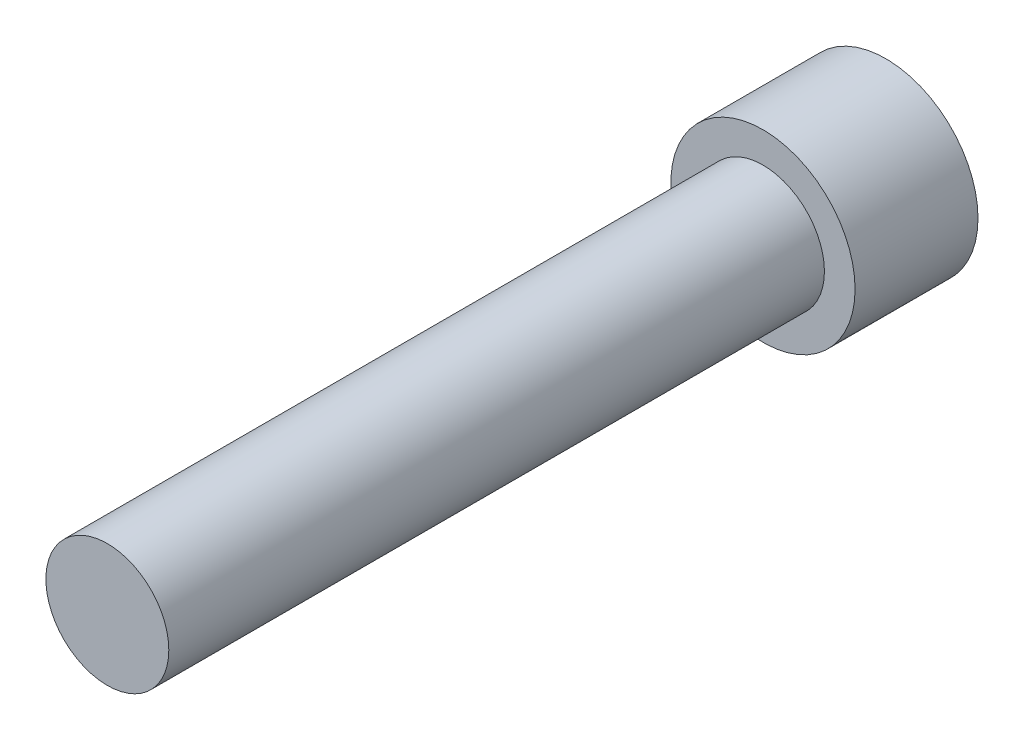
ISO-10303-21;
HEADER;
FILE_DESCRIPTION(('STEP AP214'),'2;1');
FILE_NAME('part.step','',(''),(''),'','','');
FILE_SCHEMA(('AUTOMOTIVE_DESIGN { 1 0 10303 214 1 1 1 1 }'));
ENDSEC;
DATA;
#1=APPLICATION_CONTEXT('core data for automotive mechanical design processes');
#2=APPLICATION_PROTOCOL_DEFINITION('international standard','automotive_design',2000,#1);
#3=PRODUCT_CONTEXT('',#1,'mechanical');
#4=PRODUCT('Part','Part','',(#3));
#5=PRODUCT_RELATED_PRODUCT_CATEGORY('part','',(#4));
#6=PRODUCT_DEFINITION_FORMATION('','',#4);
#7=PRODUCT_DEFINITION_CONTEXT('part definition',#1,'design');
#8=PRODUCT_DEFINITION('design','',#6,#7);
#9=PRODUCT_DEFINITION_SHAPE('','',#8);
#10=(LENGTH_UNIT() NAMED_UNIT(*) SI_UNIT(.MILLI.,.METRE.));
#11=(NAMED_UNIT(*) PLANE_ANGLE_UNIT() SI_UNIT($,.RADIAN.));
#12=(NAMED_UNIT(*) SI_UNIT($,.STERADIAN.) SOLID_ANGLE_UNIT());
#13=UNCERTAINTY_MEASURE_WITH_UNIT(LENGTH_MEASURE(1.E-05),#10,'distance_accuracy_value','');
#14=(GEOMETRIC_REPRESENTATION_CONTEXT(3) GLOBAL_UNCERTAINTY_ASSIGNED_CONTEXT((#13)) GLOBAL_UNIT_ASSIGNED_CONTEXT((#10,
#11,#12)) REPRESENTATION_CONTEXT('',''));
#15=CARTESIAN_POINT('',(0.,0.,0.));
#16=DIRECTION('',(0.,0.,1.));
#17=DIRECTION('',(1.,0.,0.));
#18=AXIS2_PLACEMENT_3D('',#15,#16,#17);
#19=CARTESIAN_POINT('',(0.,0.,50.8));
#20=DIRECTION('',(0.,0.,1.));
#21=DIRECTION('',(1.,0.,0.));
#22=AXIS2_PLACEMENT_3D('',#19,#20,#21);
#23=PLANE('',#22);
#24=CARTESIAN_POINT('',(0.,0.,50.8));
#25=DIRECTION('',(0.,0.,1.));
#26=DIRECTION('',(1.,0.,0.));
#27=AXIS2_PLACEMENT_3D('',#24,#25,#26);
#28=CIRCLE('',#27,4.7625);
#29=CARTESIAN_POINT('',(4.7625,0.,50.8));
#30=VERTEX_POINT('',#29);
#31=EDGE_CURVE('E11',#30,#30,#28,.T.);
#32=ORIENTED_EDGE('',*,*,#31,.T.);
#33=EDGE_LOOP('',(#32));
#34=FACE_BOUND('',#33,.T.);
#35=ADVANCED_FACE('F32',(#34),#23,.T.);
#36=CARTESIAN_POINT('',(0.,0.,50.8));
#37=DIRECTION('',(0.,0.,1.));
#38=DIRECTION('',(1.,0.,0.));
#39=AXIS2_PLACEMENT_3D('',#36,#37,#38);
#40=CYLINDRICAL_SURFACE('',#39,4.7625);
#41=CARTESIAN_POINT('',(0.,0.,0.));
#42=DIRECTION('',(0.,0.,1.));
#43=DIRECTION('',(1.,0.,0.));
#44=AXIS2_PLACEMENT_3D('',#41,#42,#43);
#45=CIRCLE('',#44,4.7625);
#46=CARTESIAN_POINT('',(4.7625,0.,0.));
#47=VERTEX_POINT('',#46);
#48=EDGE_CURVE('E39',#47,#47,#45,.T.);
#49=ORIENTED_EDGE('',*,*,#48,.T.);
#50=EDGE_LOOP('',(#49));
#51=FACE_BOUND('',#50,.T.);
#52=ORIENTED_EDGE('',*,*,#31,.F.);
#53=EDGE_LOOP('',(#52));
#54=FACE_BOUND('',#53,.T.);
#55=ADVANCED_FACE('F146',(#51,#54),#40,.T.);
#56=CARTESIAN_POINT('',(0.,-4.7625,0.));
#57=DIRECTION('',(0.,0.,1.));
#58=DIRECTION('',(1.,0.,0.));
#59=AXIS2_PLACEMENT_3D('',#56,#57,#58);
#60=PLANE('',#59);
#61=CARTESIAN_POINT('',(0.,0.,0.));
#62=DIRECTION('',(0.,0.,1.));
#63=DIRECTION('',(1.,0.,0.));
#64=AXIS2_PLACEMENT_3D('',#61,#62,#63);
#65=CIRCLE('',#64,7.1374);
#66=CARTESIAN_POINT('',(7.1374,0.,0.));
#67=VERTEX_POINT('',#66);
#68=EDGE_CURVE('E141',#67,#67,#65,.T.);
#69=ORIENTED_EDGE('',*,*,#68,.T.);
#70=EDGE_LOOP('',(#69));
#71=FACE_BOUND('',#70,.T.);
#72=ORIENTED_EDGE('',*,*,#48,.F.);
#73=EDGE_LOOP('',(#72));
#74=FACE_BOUND('',#73,.T.);
#75=ADVANCED_FACE('F149',(#71,#74),#60,.T.);
#76=CARTESIAN_POINT('',(0.,0.,50.8));
#77=DIRECTION('',(0.,0.,1.));
#78=DIRECTION('',(1.,0.,0.));
#79=AXIS2_PLACEMENT_3D('',#76,#77,#78);
#80=CYLINDRICAL_SURFACE('',#79,7.1374);
#81=CARTESIAN_POINT('',(0.,0.,-9.525));
#82=DIRECTION('',(0.,0.,1.));
#83=DIRECTION('',(1.,0.,0.));
#84=AXIS2_PLACEMENT_3D('',#81,#82,#83);
#85=CIRCLE('',#84,7.1374);
#86=CARTESIAN_POINT('',(7.1374,0.,-9.525));
#87=VERTEX_POINT('',#86);
#88=EDGE_CURVE('E133',#87,#87,#85,.T.);
#89=ORIENTED_EDGE('',*,*,#88,.T.);
#90=EDGE_LOOP('',(#89));
#91=FACE_BOUND('',#90,.T.);
#92=ORIENTED_EDGE('',*,*,#68,.F.);
#93=EDGE_LOOP('',(#92));
#94=FACE_BOUND('',#93,.T.);
#95=ADVANCED_FACE('F151',(#91,#94),#80,.T.);
#96=CARTESIAN_POINT('',(0.,-7.1374,-9.525));
#97=DIRECTION('',(0.,0.,-1.));
#98=DIRECTION('',(-1.,0.,0.));
#99=AXIS2_PLACEMENT_3D('',#96,#97,#98);
#100=PLANE('',#99);
#101=DIRECTION('',(0.866025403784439,-0.5,0.));
#102=VECTOR('',#101,1.);
#103=CARTESIAN_POINT('',(0.,4.57538541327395,-9.525));
#104=LINE('',#103,#102);
#105=CARTESIAN_POINT('',(0.,4.57538541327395,-9.525));
#106=VERTEX_POINT('',#105);
#107=CARTESIAN_POINT('',(3.9624,2.28769270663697,-9.525));
#108=VERTEX_POINT('',#107);
#109=EDGE_CURVE('E46',#106,#108,#104,.T.);
#110=ORIENTED_EDGE('',*,*,#109,.F.);
#111=DIRECTION('',(0.866025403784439,0.5,0.));
#112=VECTOR('',#111,1.);
#113=CARTESIAN_POINT('',(-3.9624,2.28769270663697,-9.525));
#114=LINE('',#113,#112);
#115=CARTESIAN_POINT('',(-3.9624,2.28769270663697,-9.525));
#116=VERTEX_POINT('',#115);
#117=EDGE_CURVE('E129',#116,#106,#114,.T.);
#118=ORIENTED_EDGE('',*,*,#117,.F.);
#119=DIRECTION('',(0.,1.,0.));
#120=VECTOR('',#119,1.);
#121=CARTESIAN_POINT('',(-3.9624,-2.28769270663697,-9.525));
#122=LINE('',#121,#120);
#123=CARTESIAN_POINT('',(-3.9624,-2.28769270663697,-9.525));
#124=VERTEX_POINT('',#123);
#125=EDGE_CURVE('E127',#124,#116,#122,.T.);
#126=ORIENTED_EDGE('',*,*,#125,.F.);
#127=DIRECTION('',(-0.866025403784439,0.5,0.));
#128=VECTOR('',#127,1.);
#129=CARTESIAN_POINT('',(0.,-4.57538541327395,-9.525));
#130=LINE('',#129,#128);
#131=CARTESIAN_POINT('',(0.,-4.57538541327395,-9.525));
#132=VERTEX_POINT('',#131);
#133=EDGE_CURVE('E94',#132,#124,#130,.T.);
#134=ORIENTED_EDGE('',*,*,#133,.F.);
#135=DIRECTION('',(-0.866025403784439,-0.5,0.));
#136=VECTOR('',#135,1.);
#137=CARTESIAN_POINT('',(3.9624,-2.28769270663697,-9.525));
#138=LINE('',#137,#136);
#139=CARTESIAN_POINT('',(3.9624,-2.28769270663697,-9.525));
#140=VERTEX_POINT('',#139);
#141=EDGE_CURVE('E123',#140,#132,#138,.T.);
#142=ORIENTED_EDGE('',*,*,#141,.F.);
#143=DIRECTION('',(0.,-1.,0.));
#144=VECTOR('',#143,1.);
#145=CARTESIAN_POINT('',(3.9624,2.28769270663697,-9.525));
#146=LINE('',#145,#144);
#147=EDGE_CURVE('E120',#108,#140,#146,.T.);
#148=ORIENTED_EDGE('',*,*,#147,.F.);
#149=EDGE_LOOP('',(#110,#118,#126,#134,#142,#148));
#150=FACE_BOUND('',#149,.T.);
#151=ORIENTED_EDGE('',*,*,#88,.F.);
#152=EDGE_LOOP('',(#151));
#153=FACE_BOUND('',#152,.T.);
#154=ADVANCED_FACE('F158',(#150,#153),#100,.T.);
#155=CARTESIAN_POINT('',(0.,4.57538541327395,-3.683));
#156=DIRECTION('',(0.5,0.866025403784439,0.));
#157=DIRECTION('',(-0.866025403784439,0.5,0.));
#158=AXIS2_PLACEMENT_3D('',#155,#156,#157);
#159=PLANE('',#158);
#160=ORIENTED_EDGE('',*,*,#109,.T.);
#161=DIRECTION('',(0.,0.,-1.));
#162=VECTOR('',#161,1.);
#163=CARTESIAN_POINT('',(3.9624,2.28769270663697,-3.683));
#164=LINE('',#163,#162);
#165=CARTESIAN_POINT('',(3.9624,2.28769270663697,-3.683));
#166=VERTEX_POINT('',#165);
#167=EDGE_CURVE('E76',#166,#108,#164,.T.);
#168=ORIENTED_EDGE('',*,*,#167,.F.);
#169=DIRECTION('',(0.866025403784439,-0.5,0.));
#170=VECTOR('',#169,1.);
#171=CARTESIAN_POINT('',(0.,4.57538541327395,-3.683));
#172=LINE('',#171,#170);
#173=CARTESIAN_POINT('',(0.,4.57538541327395,-3.683));
#174=VERTEX_POINT('',#173);
#175=EDGE_CURVE('E131',#174,#166,#172,.T.);
#176=ORIENTED_EDGE('',*,*,#175,.F.);
#177=DIRECTION('',(0.,0.,-1.));
#178=VECTOR('',#177,1.);
#179=CARTESIAN_POINT('',(0.,4.57538541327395,-3.683));
#180=LINE('',#179,#178);
#181=EDGE_CURVE('E54',#174,#106,#180,.T.);
#182=ORIENTED_EDGE('',*,*,#181,.T.);
#183=EDGE_LOOP('',(#160,#168,#176,#182));
#184=FACE_BOUND('',#183,.T.);
#185=ADVANCED_FACE('F189',(#184),#159,.F.);
#186=CARTESIAN_POINT('',(-3.9624,2.28769270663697,-3.683));
#187=DIRECTION('',(-0.5,0.866025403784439,0.));
#188=DIRECTION('',(-0.866025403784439,-0.5,0.));
#189=AXIS2_PLACEMENT_3D('',#186,#187,#188);
#190=PLANE('',#189);
#191=ORIENTED_EDGE('',*,*,#117,.T.);
#192=ORIENTED_EDGE('',*,*,#181,.F.);
#193=DIRECTION('',(0.866025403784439,0.5,0.));
#194=VECTOR('',#193,1.);
#195=CARTESIAN_POINT('',(-3.9624,2.28769270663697,-3.683));
#196=LINE('',#195,#194);
#197=CARTESIAN_POINT('',(-3.9624,2.28769270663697,-3.683));
#198=VERTEX_POINT('',#197);
#199=EDGE_CURVE('E106',#198,#174,#196,.T.);
#200=ORIENTED_EDGE('',*,*,#199,.F.);
#201=DIRECTION('',(0.,0.,-1.));
#202=VECTOR('',#201,1.);
#203=CARTESIAN_POINT('',(-3.9624,2.28769270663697,-3.683));
#204=LINE('',#203,#202);
#205=EDGE_CURVE('E98',#198,#116,#204,.T.);
#206=ORIENTED_EDGE('',*,*,#205,.T.);
#207=EDGE_LOOP('',(#191,#192,#200,#206));
#208=FACE_BOUND('',#207,.T.);
#209=ADVANCED_FACE('F199',(#208),#190,.F.);
#210=CARTESIAN_POINT('',(-3.9624,-2.28769270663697,-3.683));
#211=DIRECTION('',(-1.,0.,0.));
#212=DIRECTION('',(0.,0.,1.));
#213=AXIS2_PLACEMENT_3D('',#210,#211,#212);
#214=PLANE('',#213);
#215=ORIENTED_EDGE('',*,*,#125,.T.);
#216=ORIENTED_EDGE('',*,*,#205,.F.);
#217=DIRECTION('',(0.,1.,0.));
#218=VECTOR('',#217,1.);
#219=CARTESIAN_POINT('',(-3.9624,-2.28769270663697,-3.683));
#220=LINE('',#219,#218);
#221=CARTESIAN_POINT('',(-3.9624,-2.28769270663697,-3.683));
#222=VERTEX_POINT('',#221);
#223=EDGE_CURVE('E102',#222,#198,#220,.T.);
#224=ORIENTED_EDGE('',*,*,#223,.F.);
#225=DIRECTION('',(0.,0.,-1.));
#226=VECTOR('',#225,1.);
#227=CARTESIAN_POINT('',(-3.9624,-2.28769270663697,-3.683));
#228=LINE('',#227,#226);
#229=EDGE_CURVE('E87',#222,#124,#228,.T.);
#230=ORIENTED_EDGE('',*,*,#229,.T.);
#231=EDGE_LOOP('',(#215,#216,#224,#230));
#232=FACE_BOUND('',#231,.T.);
#233=ADVANCED_FACE('F103',(#232),#214,.F.);
#234=CARTESIAN_POINT('',(0.,-4.57538541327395,-3.683));
#235=DIRECTION('',(-0.5,-0.866025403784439,0.));
#236=DIRECTION('',(0.866025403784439,-0.5,0.));
#237=AXIS2_PLACEMENT_3D('',#234,#235,#236);
#238=PLANE('',#237);
#239=ORIENTED_EDGE('',*,*,#133,.T.);
#240=ORIENTED_EDGE('',*,*,#229,.F.);
#241=DIRECTION('',(-0.866025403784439,0.5,0.));
#242=VECTOR('',#241,1.);
#243=CARTESIAN_POINT('',(0.,-4.57538541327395,-3.683));
#244=LINE('',#243,#242);
#245=CARTESIAN_POINT('',(0.,-4.57538541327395,-3.683));
#246=VERTEX_POINT('',#245);
#247=EDGE_CURVE('E91',#246,#222,#244,.T.);
#248=ORIENTED_EDGE('',*,*,#247,.F.);
#249=DIRECTION('',(0.,0.,-1.));
#250=VECTOR('',#249,1.);
#251=CARTESIAN_POINT('',(0.,-4.57538541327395,-3.683));
#252=LINE('',#251,#250);
#253=EDGE_CURVE('E99',#246,#132,#252,.T.);
#254=ORIENTED_EDGE('',*,*,#253,.T.);
#255=EDGE_LOOP('',(#239,#240,#248,#254));
#256=FACE_BOUND('',#255,.T.);
#257=ADVANCED_FACE('F89',(#256),#238,.F.);
#258=CARTESIAN_POINT('',(3.9624,-2.28769270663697,-3.683));
#259=DIRECTION('',(0.5,-0.866025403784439,0.));
#260=DIRECTION('',(0.866025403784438,0.5,0.));
#261=AXIS2_PLACEMENT_3D('',#258,#259,#260);
#262=PLANE('',#261);
#263=ORIENTED_EDGE('',*,*,#141,.T.);
#264=ORIENTED_EDGE('',*,*,#253,.F.);
#265=DIRECTION('',(-0.866025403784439,-0.5,0.));
#266=VECTOR('',#265,1.);
#267=CARTESIAN_POINT('',(3.9624,-2.28769270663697,-3.683));
#268=LINE('',#267,#266);
#269=CARTESIAN_POINT('',(3.9624,-2.28769270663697,-3.683));
#270=VERTEX_POINT('',#269);
#271=EDGE_CURVE('E112',#270,#246,#268,.T.);
#272=ORIENTED_EDGE('',*,*,#271,.F.);
#273=DIRECTION('',(0.,0.,-1.));
#274=VECTOR('',#273,1.);
#275=CARTESIAN_POINT('',(3.9624,-2.28769270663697,-3.683));
#276=LINE('',#275,#274);
#277=EDGE_CURVE('E136',#270,#140,#276,.T.);
#278=ORIENTED_EDGE('',*,*,#277,.T.);
#279=EDGE_LOOP('',(#263,#264,#272,#278));
#280=FACE_BOUND('',#279,.T.);
#281=ADVANCED_FACE('F224',(#280),#262,.F.);
#282=CARTESIAN_POINT('',(3.9624,2.28769270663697,-3.683));
#283=DIRECTION('',(1.,0.,0.));
#284=DIRECTION('',(0.,0.,-1.));
#285=AXIS2_PLACEMENT_3D('',#282,#283,#284);
#286=PLANE('',#285);
#287=ORIENTED_EDGE('',*,*,#147,.T.);
#288=ORIENTED_EDGE('',*,*,#277,.F.);
#289=DIRECTION('',(0.,-1.,0.));
#290=VECTOR('',#289,1.);
#291=CARTESIAN_POINT('',(3.9624,2.28769270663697,-3.683));
#292=LINE('',#291,#290);
#293=EDGE_CURVE('E114',#166,#270,#292,.T.);
#294=ORIENTED_EDGE('',*,*,#293,.F.);
#295=ORIENTED_EDGE('',*,*,#167,.T.);
#296=EDGE_LOOP('',(#287,#288,#294,#295));
#297=FACE_BOUND('',#296,.T.);
#298=ADVANCED_FACE('F233',(#297),#286,.F.);
#299=CARTESIAN_POINT('',(7.9248,0.,-3.683));
#300=DIRECTION('',(0.,0.,-1.));
#301=DIRECTION('',(-1.,0.,0.));
#302=AXIS2_PLACEMENT_3D('',#299,#300,#301);
#303=PLANE('',#302);
#304=ORIENTED_EDGE('',*,*,#175,.T.);
#305=ORIENTED_EDGE('',*,*,#293,.T.);
#306=ORIENTED_EDGE('',*,*,#271,.T.);
#307=ORIENTED_EDGE('',*,*,#247,.T.);
#308=ORIENTED_EDGE('',*,*,#223,.T.);
#309=ORIENTED_EDGE('',*,*,#199,.T.);
#310=EDGE_LOOP('',(#304,#305,#306,#307,#308,#309));
#311=FACE_BOUND('',#310,.T.);
#312=ADVANCED_FACE('F109',(#311),#303,.T.);
#313=CLOSED_SHELL('',(#35,#55,#75,#95,#154,#185,#209,#233,#257,#281,#298,#312));
#314=MANIFOLD_SOLID_BREP('B2',#313);
#315=ADVANCED_BREP_SHAPE_REPRESENTATION('',(#18,#314),#14);
#316=SHAPE_DEFINITION_REPRESENTATION(#9,#315);
ENDSEC;
END-ISO-10303-21;
